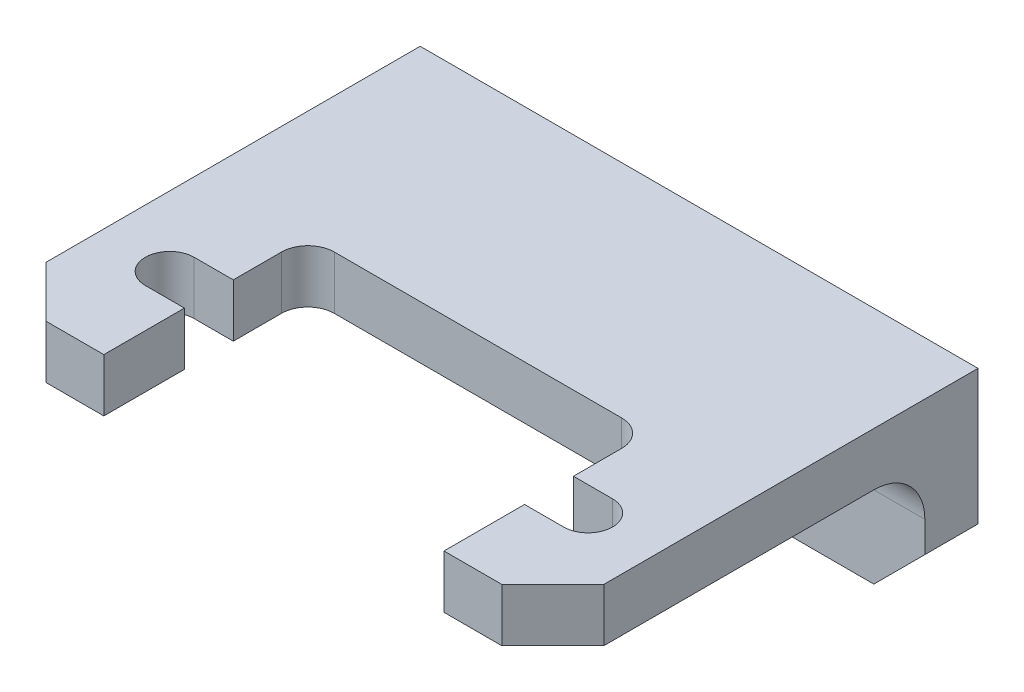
ISO-10303-21;
HEADER;
FILE_DESCRIPTION(('STEP AP214'),'2;1');
FILE_NAME('part.step','',(''),(''),'','','');
FILE_SCHEMA(('AUTOMOTIVE_DESIGN { 1 0 10303 214 1 1 1 1 }'));
ENDSEC;
DATA;
#1=APPLICATION_CONTEXT('core data for automotive mechanical design processes');
#2=APPLICATION_PROTOCOL_DEFINITION('international standard','automotive_design',2000,#1);
#3=PRODUCT_CONTEXT('',#1,'mechanical');
#4=PRODUCT('Part','Part','',(#3));
#5=PRODUCT_RELATED_PRODUCT_CATEGORY('part','',(#4));
#6=PRODUCT_DEFINITION_FORMATION('','',#4);
#7=PRODUCT_DEFINITION_CONTEXT('part definition',#1,'design');
#8=PRODUCT_DEFINITION('design','',#6,#7);
#9=PRODUCT_DEFINITION_SHAPE('','',#8);
#10=(LENGTH_UNIT() NAMED_UNIT(*) SI_UNIT(.MILLI.,.METRE.));
#11=(NAMED_UNIT(*) PLANE_ANGLE_UNIT() SI_UNIT($,.RADIAN.));
#12=(NAMED_UNIT(*) SI_UNIT($,.STERADIAN.) SOLID_ANGLE_UNIT());
#13=UNCERTAINTY_MEASURE_WITH_UNIT(LENGTH_MEASURE(1.E-05),#10,'distance_accuracy_value','');
#14=(GEOMETRIC_REPRESENTATION_CONTEXT(3) GLOBAL_UNCERTAINTY_ASSIGNED_CONTEXT((#13)) GLOBAL_UNIT_ASSIGNED_CONTEXT((#10,
#11,#12)) REPRESENTATION_CONTEXT('',''));
#15=CARTESIAN_POINT('',(0.,0.,0.));
#16=DIRECTION('',(0.,0.,1.));
#17=DIRECTION('',(1.,0.,0.));
#18=AXIS2_PLACEMENT_3D('',#15,#16,#17);
#19=CARTESIAN_POINT('',(-9.5249999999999,-1.60020000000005,-13.8490158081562));
#20=DIRECTION('',(0.,0.,-1.));
#21=DIRECTION('',(-1.,0.,0.));
#22=AXIS2_PLACEMENT_3D('',#19,#20,#21);
#23=CYLINDRICAL_SURFACE('',#22,2.99720000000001);
#24=CARTESIAN_POINT('',(-9.52500000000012,-1.60020000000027,-15.8750000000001));
#25=DIRECTION('',(0.,0.,-1.));
#26=DIRECTION('',(-1.,0.,0.));
#27=AXIS2_PLACEMENT_3D('',#24,#25,#26);
#28=CIRCLE('',#27,2.99720000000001);
#29=CARTESIAN_POINT('',(-6.5304918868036,-1.47320000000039,-15.8749999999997));
#30=VERTEX_POINT('',#29);
#31=CARTESIAN_POINT('',(-12.5195081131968,-1.47319999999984,-15.8750000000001));
#32=VERTEX_POINT('',#31);
#33=EDGE_CURVE('E224',#30,#32,#28,.F.);
#34=ORIENTED_EDGE('',*,*,#33,.F.);
#35=CARTESIAN_POINT('',(-12.5195081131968,-1.47319999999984,-15.8750000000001));
#36=CARTESIAN_POINT('',(-12.5166224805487,-1.40475595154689,-15.8750170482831));
#37=CARTESIAN_POINT('',(-12.5113573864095,-1.33642906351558,-15.8726952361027));
#38=CARTESIAN_POINT('',(-12.4962289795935,-1.20064891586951,-15.863547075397));
#39=CARTESIAN_POINT('',(-12.4863696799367,-1.13319494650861,-15.8567246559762));
#40=CARTESIAN_POINT('',(-12.4623088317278,-1.00023579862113,-15.8388229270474));
#41=CARTESIAN_POINT('',(-12.4481442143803,-0.934719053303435,-15.8277796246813));
#42=CARTESIAN_POINT('',(-12.4157014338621,-0.805533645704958,-15.8017056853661));
#43=CARTESIAN_POINT('',(-12.3974225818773,-0.741865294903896,-15.7866743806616));
#44=CARTESIAN_POINT('',(-12.3369724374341,-0.554670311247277,-15.7361634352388));
#45=CARTESIAN_POINT('',(-12.2890836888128,-0.434398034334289,-15.6951879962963));
#46=CARTESIAN_POINT('',(-12.1805678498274,-0.204711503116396,-15.6012961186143));
#47=CARTESIAN_POINT('',(-12.1199169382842,-0.0953181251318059,-15.5483573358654));
#48=CARTESIAN_POINT('',(-11.9706752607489,0.139348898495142,-15.4178488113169));
#49=CARTESIAN_POINT('',(-11.8789487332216,0.261059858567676,-15.337476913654));
#50=CARTESIAN_POINT('',(-11.6825039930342,0.485643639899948,-15.1664924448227));
#51=CARTESIAN_POINT('',(-11.5777541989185,0.58846910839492,-15.0758550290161));
#52=CARTESIAN_POINT('',(-11.3862249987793,0.751504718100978,-14.9128173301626));
#53=CARTESIAN_POINT('',(-11.3017826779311,0.815864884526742,-14.8417457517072));
#54=CARTESIAN_POINT('',(-11.1274555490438,0.934854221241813,-14.6979058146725));
#55=CARTESIAN_POINT('',(-11.0375651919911,0.98947323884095,-14.6251357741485));
#56=CARTESIAN_POINT('',(-10.852491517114,1.08903851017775,-14.4801651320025));
#57=CARTESIAN_POINT('',(-10.7573185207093,1.13400284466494,-14.4079637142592));
#58=CARTESIAN_POINT('',(-10.5606922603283,1.21437705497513,-14.2670496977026));
#59=CARTESIAN_POINT('',(-10.4592501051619,1.24980326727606,-14.1983312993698));
#60=CARTESIAN_POINT('',(-10.2847426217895,1.29998976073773,-14.0926498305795));
#61=CARTESIAN_POINT('',(-10.2141658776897,1.3176440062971,-14.0529880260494));
#62=CARTESIAN_POINT('',(-10.0684906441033,1.34824863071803,-13.9807992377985));
#63=CARTESIAN_POINT('',(-9.99340282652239,1.3612096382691,-13.948256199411));
#64=CARTESIAN_POINT('',(-9.85709220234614,1.37913182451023,-13.9017007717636));
#65=CARTESIAN_POINT('',(-9.79694079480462,1.38527213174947,-13.8851062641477));
#66=CARTESIAN_POINT('',(-9.67457589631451,1.39388931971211,-13.8615384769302));
#67=CARTESIAN_POINT('',(-9.61236841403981,1.39637605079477,-13.8545393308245));
#68=CARTESIAN_POINT('',(-9.48734614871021,1.39741779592,-13.8516279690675));
#69=CARTESIAN_POINT('',(-9.4245298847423,1.39595412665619,-13.8557684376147));
#70=CARTESIAN_POINT('',(-9.30059697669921,1.38923597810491,-13.8743073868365));
#71=CARTESIAN_POINT('',(-9.23948475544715,1.38397244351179,-13.888730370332));
#72=CARTESIAN_POINT('',(-9.08682424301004,1.36627804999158,-13.935404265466));
#73=CARTESIAN_POINT('',(-8.99729035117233,1.3514877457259,-13.9731109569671));
#74=CARTESIAN_POINT('',(-8.82440505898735,1.31531769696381,-14.058522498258));
#75=CARTESIAN_POINT('',(-8.7410885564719,1.29390379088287,-14.1062787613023));
#76=CARTESIAN_POINT('',(-8.56987153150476,1.2423038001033,-14.2127305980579));
#77=CARTESIAN_POINT('',(-8.48258982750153,1.21138085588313,-14.2720520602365));
#78=CARTESIAN_POINT('',(-8.31275532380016,1.14243941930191,-14.3934062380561));
#79=CARTESIAN_POINT('',(-8.23020792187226,1.10441303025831,-14.4554419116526));
#80=CARTESIAN_POINT('',(-8.06948639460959,1.02140984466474,-14.5799440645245));
#81=CARTESIAN_POINT('',(-7.99130012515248,0.976453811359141,-14.6424087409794));
#82=CARTESIAN_POINT('',(-7.83886538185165,0.879379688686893,-14.7665572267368));
#83=CARTESIAN_POINT('',(-7.76461571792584,0.827263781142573,-14.8282412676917));
#84=CARTESIAN_POINT('',(-7.67378082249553,0.757075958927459,-14.9046494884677));
#85=CARTESIAN_POINT('',(-7.65527024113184,0.742422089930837,-14.9202717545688));
#86=CARTESIAN_POINT('',(-7.61852526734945,0.712616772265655,-14.9513759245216));
#87=CARTESIAN_POINT('',(-7.60029095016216,0.69746519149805,-14.9668577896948));
#88=CARTESIAN_POINT('',(-7.46624378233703,0.583359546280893,-15.0809631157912));
#89=CARTESIAN_POINT('',(-7.35598233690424,0.474305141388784,-15.1764545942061));
#90=CARTESIAN_POINT('',(-7.14983494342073,0.234672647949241,-15.3560112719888));
#91=CARTESIAN_POINT('',(-7.05396394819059,0.104072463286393,-15.4400645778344));
#92=CARTESIAN_POINT('',(-6.89996219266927,-0.147872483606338,-15.5746542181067));
#93=CARTESIAN_POINT('',(-6.83814871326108,-0.265172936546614,-15.6285114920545));
#94=CARTESIAN_POINT('',(-6.72932961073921,-0.511430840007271,-15.7222596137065));
#95=CARTESIAN_POINT('',(-6.68227701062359,-0.640349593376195,-15.7621948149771));
#96=CARTESIAN_POINT('',(-6.62801302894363,-0.829443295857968,-15.8067969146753));
#97=CARTESIAN_POINT('',(-6.61354327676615,-0.88600629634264,-15.8184694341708));
#98=CARTESIAN_POINT('',(-6.5878411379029,-1.00041992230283,-15.8386690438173));
#99=CARTESIAN_POINT('',(-6.57660804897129,-1.05827026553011,-15.8471968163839));
#100=CARTESIAN_POINT('',(-6.55747321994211,-1.17531173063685,-15.8609841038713));
#101=CARTESIAN_POINT('',(-6.54959452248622,-1.23450927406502,-15.8662211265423));
#102=CARTESIAN_POINT('',(-6.53736767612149,-1.35350885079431,-15.8732351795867));
#103=CARTESIAN_POINT('',(-6.53302181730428,-1.41331125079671,-15.875009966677));
#104=CARTESIAN_POINT('',(-6.5304918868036,-1.47320000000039,-15.8749999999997));
#105=B_SPLINE_CURVE_WITH_KNOTS('',3,(#35,#36,#37,#38,#39,#40,#41,#42,#43,#44,#45,#46,#47,#48,
#49,#50,#51,#52,#53,#54,#55,#56,#57,#58,#59,#60,#61,#62,#63,#64,#65,#66,#67,#68,#69,#70,#71,#72,
#73,#74,#75,#76,#77,#78,#79,#80,#81,#82,#83,#84,#85,#86,#87,#88,#89,#90,#91,#92,#93,#94,#95,#96,
#97,#98,#99,#100,#101,#102,#103,#104),.UNSPECIFIED.,.F.,.F.,(4,2,2,2,2,2,2,2,2,2,2,2,2,2,2,2,2,
2,2,2,2,2,2,2,2,2,2,2,2,2,2,2,2,2,4),(0.,0.205408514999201,0.410637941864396,0.614154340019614,
0.817704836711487,1.22311627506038,1.62929125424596,2.14395478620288,2.65989165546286,
3.04270422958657,3.42591348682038,3.80839870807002,4.19022459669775,4.43846688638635,
4.68614341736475,4.8735608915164,5.06047213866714,5.24826892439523,5.43651472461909,
5.72964985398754,6.02432278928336,6.35375997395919,6.68356558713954,7.01240155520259,
7.34113753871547,7.42606121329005,7.51100761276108,8.0553158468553,8.60018580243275,
9.02794088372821,9.45432047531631,9.6327939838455,9.8112287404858,9.99087019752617,
10.1706280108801),.UNSPECIFIED.);
#106=EDGE_CURVE('E213',#32,#30,#105,.T.);
#107=ORIENTED_EDGE('',*,*,#106,.F.);
#108=EDGE_LOOP('',(#34,#107));
#109=FACE_BOUND('',#108,.T.);
#110=ADVANCED_FACE('F32',(#109),#23,.F.);
#111=CARTESIAN_POINT('',(9.52500000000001,-1.60020000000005,-13.8490158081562));
#112=DIRECTION('',(0.,0.,-1.));
#113=DIRECTION('',(-1.,0.,0.));
#114=AXIS2_PLACEMENT_3D('',#111,#112,#113);
#115=CYLINDRICAL_SURFACE('',#114,2.99720000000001);
#116=CARTESIAN_POINT('',(9.52499999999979,-1.60020000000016,-15.875));
#117=DIRECTION('',(0.,0.,-1.));
#118=DIRECTION('',(-1.,0.,0.));
#119=AXIS2_PLACEMENT_3D('',#116,#117,#118);
#120=CIRCLE('',#119,2.99720000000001);
#121=CARTESIAN_POINT('',(12.5195081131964,-1.47320000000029,-15.8749999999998));
#122=VERTEX_POINT('',#121);
#123=CARTESIAN_POINT('',(6.53049188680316,-1.47320000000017,-15.8750000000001));
#124=VERTEX_POINT('',#123);
#125=EDGE_CURVE('E230',#122,#124,#120,.F.);
#126=ORIENTED_EDGE('',*,*,#125,.F.);
#127=CARTESIAN_POINT('',(6.53049188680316,-1.47320000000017,-15.8750000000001));
#128=CARTESIAN_POINT('',(6.53337751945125,-1.40475595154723,-15.8750170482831));
#129=CARTESIAN_POINT('',(6.53864261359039,-1.33642906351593,-15.8726952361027));
#130=CARTESIAN_POINT('',(6.55377102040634,-1.20064891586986,-15.8635470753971));
#131=CARTESIAN_POINT('',(6.56363032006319,-1.13319494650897,-15.8567246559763));
#132=CARTESIAN_POINT('',(6.58769116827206,-1.00023579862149,-15.8388229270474));
#133=CARTESIAN_POINT('',(6.60185578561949,-0.934719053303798,-15.8277796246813));
#134=CARTESIAN_POINT('',(6.63429856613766,-0.80553364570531,-15.8017056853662));
#135=CARTESIAN_POINT('',(6.6525774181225,-0.741865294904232,-15.7866743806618));
#136=CARTESIAN_POINT('',(6.71302756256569,-0.554670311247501,-15.7361634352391));
#137=CARTESIAN_POINT('',(6.76091631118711,-0.434398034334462,-15.6951879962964));
#138=CARTESIAN_POINT('',(6.86943215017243,-0.204711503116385,-15.6012961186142));
#139=CARTESIAN_POINT('',(6.93008306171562,-0.0953181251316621,-15.5483573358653));
#140=CARTESIAN_POINT('',(7.07932473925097,0.139348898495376,-15.4178488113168));
#141=CARTESIAN_POINT('',(7.17105126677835,0.261059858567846,-15.3374769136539));
#142=CARTESIAN_POINT('',(7.36749600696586,0.485643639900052,-15.1664924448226));
#143=CARTESIAN_POINT('',(7.47224580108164,0.588469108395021,-15.075855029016));
#144=CARTESIAN_POINT('',(7.66377500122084,0.751504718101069,-14.9128173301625));
#145=CARTESIAN_POINT('',(7.74821732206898,0.815864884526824,-14.8417457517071));
#146=CARTESIAN_POINT('',(7.92254445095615,0.934854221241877,-14.6979058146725));
#147=CARTESIAN_POINT('',(8.01243480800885,0.989473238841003,-14.6251357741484));
#148=CARTESIAN_POINT('',(8.1975084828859,1.08903851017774,-14.4801651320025));
#149=CARTESIAN_POINT('',(8.29268147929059,1.13400284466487,-14.4079637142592));
#150=CARTESIAN_POINT('',(8.48930773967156,1.21437705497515,-14.2670496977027));
#151=CARTESIAN_POINT('',(8.59074989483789,1.24980326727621,-14.19833129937));
#152=CARTESIAN_POINT('',(8.76525737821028,1.29998976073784,-14.0926498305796));
#153=CARTESIAN_POINT('',(8.83583412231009,1.31764400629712,-14.0529880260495));
#154=CARTESIAN_POINT('',(8.98150935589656,1.34824863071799,-13.9807992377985));
#155=CARTESIAN_POINT('',(9.05659717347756,1.36120963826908,-13.948256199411));
#156=CARTESIAN_POINT('',(9.19290779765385,1.37913182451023,-13.9017007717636));
#157=CARTESIAN_POINT('',(9.25305920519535,1.38527213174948,-13.8851062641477));
#158=CARTESIAN_POINT('',(9.37542410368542,1.39388931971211,-13.8615384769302));
#159=CARTESIAN_POINT('',(9.4376315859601,1.39637605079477,-13.8545393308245));
#160=CARTESIAN_POINT('',(9.56265385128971,1.39741779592,-13.8516279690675));
#161=CARTESIAN_POINT('',(9.62547011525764,1.39595412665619,-13.8557684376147));
#162=CARTESIAN_POINT('',(9.74940302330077,1.38923597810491,-13.8743073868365));
#163=CARTESIAN_POINT('',(9.81051524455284,1.38397244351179,-13.8887303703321));
#164=CARTESIAN_POINT('',(9.96317575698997,1.36627804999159,-13.9354042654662));
#165=CARTESIAN_POINT('',(10.0527096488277,1.35148774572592,-13.9731109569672));
#166=CARTESIAN_POINT('',(10.2255949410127,1.31531769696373,-14.058522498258));
#167=CARTESIAN_POINT('',(10.3089114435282,1.29390379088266,-14.1062787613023));
#168=CARTESIAN_POINT('',(10.4801284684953,1.24230380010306,-14.2127305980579));
#169=CARTESIAN_POINT('',(10.5674101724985,1.21138085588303,-14.2720520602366));
#170=CARTESIAN_POINT('',(10.7372446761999,1.1424394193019,-14.3934062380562));
#171=CARTESIAN_POINT('',(10.8197920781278,1.10441303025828,-14.4554419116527));
#172=CARTESIAN_POINT('',(10.9805136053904,1.02140984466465,-14.5799440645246));
#173=CARTESIAN_POINT('',(11.0586998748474,0.976453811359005,-14.6424087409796));
#174=CARTESIAN_POINT('',(11.2111346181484,0.879379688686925,-14.7665572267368));
#175=CARTESIAN_POINT('',(11.2853842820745,0.827263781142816,-14.8282412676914));
#176=CARTESIAN_POINT('',(11.3762191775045,0.757075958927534,-14.9046494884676));
#177=CARTESIAN_POINT('',(11.3947297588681,0.742422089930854,-14.9202717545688));
#178=CARTESIAN_POINT('',(11.4314747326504,0.712616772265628,-14.9513759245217));
#179=CARTESIAN_POINT('',(11.4497090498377,0.697465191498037,-14.9668577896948));
#180=CARTESIAN_POINT('',(11.583756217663,0.58335954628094,-15.0809631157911));
#181=CARTESIAN_POINT('',(11.6940176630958,0.474305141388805,-15.1764545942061));
#182=CARTESIAN_POINT('',(11.9001650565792,0.234672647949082,-15.3560112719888));
#183=CARTESIAN_POINT('',(11.9960360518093,0.10407246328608,-15.4400645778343));
#184=CARTESIAN_POINT('',(12.1500378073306,-0.147872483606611,-15.5746542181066));
#185=CARTESIAN_POINT('',(12.2118512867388,-0.265172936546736,-15.6285114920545));
#186=CARTESIAN_POINT('',(12.3206703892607,-0.511430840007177,-15.7222596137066));
#187=CARTESIAN_POINT('',(12.3677229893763,-0.640349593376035,-15.7621948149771));
#188=CARTESIAN_POINT('',(12.4219869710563,-0.829443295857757,-15.8067969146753));
#189=CARTESIAN_POINT('',(12.4364567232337,-0.886006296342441,-15.8184694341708));
#190=CARTESIAN_POINT('',(12.462158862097,-1.00041992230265,-15.8386690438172));
#191=CARTESIAN_POINT('',(12.4733919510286,-1.05827026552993,-15.8471968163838));
#192=CARTESIAN_POINT('',(12.4925267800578,-1.17531173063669,-15.8609841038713));
#193=CARTESIAN_POINT('',(12.5004054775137,-1.23450927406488,-15.8662211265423));
#194=CARTESIAN_POINT('',(12.5126323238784,-1.35350885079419,-15.8732351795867));
#195=CARTESIAN_POINT('',(12.5169781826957,-1.41331125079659,-15.8750099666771));
#196=CARTESIAN_POINT('',(12.5195081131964,-1.47320000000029,-15.8749999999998));
#197=B_SPLINE_CURVE_WITH_KNOTS('',3,(#127,#128,#129,#130,#131,#132,#133,#134,#135,#136,#137,
#138,#139,#140,#141,#142,#143,#144,#145,#146,#147,#148,#149,#150,#151,#152,#153,#154,#155,#156,
#157,#158,#159,#160,#161,#162,#163,#164,#165,#166,#167,#168,#169,#170,#171,#172,#173,#174,#175,
#176,#177,#178,#179,#180,#181,#182,#183,#184,#185,#186,#187,#188,#189,#190,#191,#192,#193,#194,
#195,#196),.UNSPECIFIED.,.F.,.F.,(4,2,2,2,2,2,2,2,2,2,2,2,2,2,2,2,2,2,2,2,2,2,2,2,2,2,2,2,2,2,2,
2,2,2,4),(0.,0.205408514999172,0.410637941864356,0.61415434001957,0.817704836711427,
1.22311627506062,1.62929125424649,2.14395478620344,2.65989165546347,3.04270422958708,
3.42591348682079,3.80839870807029,4.19022459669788,4.43846688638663,4.68614341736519,
4.87356089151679,5.06047213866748,5.24826892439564,5.43651472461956,5.72964985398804,
6.02432278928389,6.35375997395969,6.68356558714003,7.01240155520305,7.34113753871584,
7.4260612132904,7.51100761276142,8.05531584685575,8.60018580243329,9.02794088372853,
9.4543204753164,9.63279398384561,9.81122874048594,9.99087019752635,10.1706280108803),.UNSPECIFIED.);
#198=EDGE_CURVE('E208',#124,#122,#197,.T.);
#199=ORIENTED_EDGE('',*,*,#198,.F.);
#200=EDGE_LOOP('',(#126,#199));
#201=FACE_BOUND('',#200,.T.);
#202=ADVANCED_FACE('F267',(#201),#115,.F.);
#203=CARTESIAN_POINT('',(13.6143999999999,-6.35000000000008,-15.875));
#204=DIRECTION('',(0.707106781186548,-0.707106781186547,0.));
#205=DIRECTION('',(0.,0.,-1.));
#206=AXIS2_PLACEMENT_3D('',#203,#204,#205);
#207=PLANE('',#206);
#208=DIRECTION('',(-0.707106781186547,-0.707106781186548,0.));
#209=VECTOR('',#208,1.);
#210=CARTESIAN_POINT('',(16.6624000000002,-3.30200000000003,-19.05));
#211=LINE('',#210,#209);
#212=CARTESIAN_POINT('',(16.6624000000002,-3.30200000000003,-19.05));
#213=VERTEX_POINT('',#212);
#214=CARTESIAN_POINT('',(13.6144,-6.34999999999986,-19.05));
#215=VERTEX_POINT('',#214);
#216=EDGE_CURVE('E488',#213,#215,#211,.T.);
#217=ORIENTED_EDGE('',*,*,#216,.F.);
#218=DIRECTION('',(0.,0.,1.));
#219=VECTOR('',#218,1.);
#220=CARTESIAN_POINT('',(16.6624000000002,-3.30200000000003,-19.05));
#221=LINE('',#220,#219);
#222=CARTESIAN_POINT('',(16.6623999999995,-3.30200000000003,-15.8750000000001));
#223=VERTEX_POINT('',#222);
#224=EDGE_CURVE('E498',#223,#213,#221,.F.);
#225=ORIENTED_EDGE('',*,*,#224,.F.);
#226=DIRECTION('',(0.707106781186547,0.707106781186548,0.));
#227=VECTOR('',#226,1.);
#228=CARTESIAN_POINT('',(13.6143999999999,-6.35000000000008,-15.875));
#229=LINE('',#228,#227);
#230=CARTESIAN_POINT('',(13.6143999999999,-6.35000000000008,-15.875));
#231=VERTEX_POINT('',#230);
#232=EDGE_CURVE('E239',#231,#223,#229,.T.);
#233=ORIENTED_EDGE('',*,*,#232,.F.);
#234=DIRECTION('',(0.,0.,-1.));
#235=VECTOR('',#234,1.);
#236=CARTESIAN_POINT('',(13.6143999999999,-6.35000000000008,-15.875));
#237=LINE('',#236,#235);
#238=EDGE_CURVE('E36',#215,#231,#237,.F.);
#239=ORIENTED_EDGE('',*,*,#238,.F.);
#240=EDGE_LOOP('',(#217,#225,#233,#239));
#241=FACE_BOUND('',#240,.T.);
#242=ADVANCED_FACE('F271',(#241),#207,.T.);
#243=CARTESIAN_POINT('',(-13.6144000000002,-6.35000000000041,-15.875));
#244=DIRECTION('',(0.,-1.,0.));
#245=DIRECTION('',(0.,0.,-1.));
#246=AXIS2_PLACEMENT_3D('',#243,#244,#245);
#247=PLANE('',#246);
#248=DIRECTION('',(0.,0.,1.));
#249=VECTOR('',#248,1.);
#250=CARTESIAN_POINT('',(-13.6144000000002,-6.3500000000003,-19.05));
#251=LINE('',#250,#249);
#252=CARTESIAN_POINT('',(-13.6144000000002,-6.3500000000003,-19.05));
#253=VERTEX_POINT('',#252);
#254=CARTESIAN_POINT('',(-13.6144000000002,-6.35000000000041,-15.875));
#255=VERTEX_POINT('',#254);
#256=EDGE_CURVE('E231',#253,#255,#251,.T.);
#257=ORIENTED_EDGE('',*,*,#256,.F.);
#258=DIRECTION('',(-1.,0.,0.));
#259=VECTOR('',#258,1.);
#260=CARTESIAN_POINT('',(16.6623999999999,-6.35000000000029,-19.0499999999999));
#261=LINE('',#260,#259);
#262=EDGE_CURVE('E485',#215,#253,#261,.T.);
#263=ORIENTED_EDGE('',*,*,#262,.F.);
#264=ORIENTED_EDGE('',*,*,#238,.T.);
#265=DIRECTION('',(1.,0.,0.));
#266=VECTOR('',#265,1.);
#267=CARTESIAN_POINT('',(-16.6624,-6.34999999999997,-15.8750000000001));
#268=LINE('',#267,#266);
#269=EDGE_CURVE('E236',#255,#231,#268,.T.);
#270=ORIENTED_EDGE('',*,*,#269,.F.);
#271=EDGE_LOOP('',(#257,#263,#264,#270));
#272=FACE_BOUND('',#271,.T.);
#273=ADVANCED_FACE('F274',(#272),#247,.T.);
#274=CARTESIAN_POINT('',(9.5249999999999,-1.60020000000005,-19.05));
#275=DIRECTION('',(0.,0.,1.));
#276=DIRECTION('',(1.,0.,0.));
#277=AXIS2_PLACEMENT_3D('',#274,#275,#276);
#278=CYLINDRICAL_SURFACE('',#277,1.70179999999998);
#279=CARTESIAN_POINT('',(9.52499999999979,-1.60020000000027,-15.875));
#280=DIRECTION('',(0.,0.,1.));
#281=DIRECTION('',(1.,0.,0.));
#282=AXIS2_PLACEMENT_3D('',#279,#280,#281);
#283=CIRCLE('',#282,1.70179999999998);
#284=CARTESIAN_POINT('',(11.2267999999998,-1.60020000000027,-15.875));
#285=VERTEX_POINT('',#284);
#286=EDGE_CURVE('E245',#285,#285,#283,.F.);
#287=ORIENTED_EDGE('',*,*,#286,.F.);
#288=EDGE_LOOP('',(#287));
#289=FACE_BOUND('',#288,.T.);
#290=CARTESIAN_POINT('',(9.5249999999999,-1.60020000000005,-19.05));
#291=DIRECTION('',(0.,0.,1.));
#292=DIRECTION('',(1.,0.,0.));
#293=AXIS2_PLACEMENT_3D('',#290,#291,#292);
#294=CIRCLE('',#293,1.70179999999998);
#295=CARTESIAN_POINT('',(11.2267999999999,-1.60020000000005,-19.05));
#296=VERTEX_POINT('',#295);
#297=EDGE_CURVE('E476',#296,#296,#294,.F.);
#298=ORIENTED_EDGE('',*,*,#297,.T.);
#299=EDGE_LOOP('',(#298));
#300=FACE_BOUND('',#299,.T.);
#301=ADVANCED_FACE('F278',(#289,#300),#278,.F.);
#302=CARTESIAN_POINT('',(-9.52500000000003,-1.60020000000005,-19.05));
#303=DIRECTION('',(0.,0.,1.));
#304=DIRECTION('',(1.,0.,0.));
#305=AXIS2_PLACEMENT_3D('',#302,#303,#304);
#306=CYLINDRICAL_SURFACE('',#305,1.70179999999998);
#307=CARTESIAN_POINT('',(-9.52500000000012,-1.60020000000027,-15.8750000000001));
#308=DIRECTION('',(0.,0.,1.));
#309=DIRECTION('',(1.,0.,0.));
#310=AXIS2_PLACEMENT_3D('',#307,#308,#309);
#311=CIRCLE('',#310,1.70179999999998);
#312=CARTESIAN_POINT('',(-7.82320000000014,-1.60020000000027,-15.8750000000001));
#313=VERTEX_POINT('',#312);
#314=EDGE_CURVE('E248',#313,#313,#311,.F.);
#315=ORIENTED_EDGE('',*,*,#314,.F.);
#316=EDGE_LOOP('',(#315));
#317=FACE_BOUND('',#316,.T.);
#318=CARTESIAN_POINT('',(-9.52500000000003,-1.60020000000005,-19.05));
#319=DIRECTION('',(0.,0.,1.));
#320=DIRECTION('',(1.,0.,0.));
#321=AXIS2_PLACEMENT_3D('',#318,#319,#320);
#322=CIRCLE('',#321,1.70179999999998);
#323=CARTESIAN_POINT('',(-7.82320000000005,-1.60020000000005,-19.05));
#324=VERTEX_POINT('',#323);
#325=EDGE_CURVE('E473',#324,#324,#322,.F.);
#326=ORIENTED_EDGE('',*,*,#325,.T.);
#327=EDGE_LOOP('',(#326));
#328=FACE_BOUND('',#327,.T.);
#329=ADVANCED_FACE('F282',(#317,#328),#306,.F.);
#330=CARTESIAN_POINT('',(-13.6144000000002,-6.3500000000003,-19.05));
#331=DIRECTION('',(-0.707106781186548,-0.707106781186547,0.));
#332=DIRECTION('',(0.,0.,1.));
#333=AXIS2_PLACEMENT_3D('',#330,#331,#332);
#334=PLANE('',#333);
#335=DIRECTION('',(0.707106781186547,-0.707106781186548,0.));
#336=VECTOR('',#335,1.);
#337=CARTESIAN_POINT('',(-16.6624000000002,-3.30200000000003,-15.8750000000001));
#338=LINE('',#337,#336);
#339=CARTESIAN_POINT('',(-16.6624000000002,-3.30200000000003,-15.8750000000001));
#340=VERTEX_POINT('',#339);
#341=EDGE_CURVE('E226',#340,#255,#338,.T.);
#342=ORIENTED_EDGE('',*,*,#341,.F.);
#343=DIRECTION('',(0.,0.,-1.));
#344=VECTOR('',#343,1.);
#345=CARTESIAN_POINT('',(-16.6623999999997,-3.30200000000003,3.30199999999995));
#346=LINE('',#345,#344);
#347=CARTESIAN_POINT('',(-16.6624000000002,-3.30200000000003,-19.05));
#348=VERTEX_POINT('',#347);
#349=EDGE_CURVE('E470',#348,#340,#346,.F.);
#350=ORIENTED_EDGE('',*,*,#349,.F.);
#351=DIRECTION('',(-0.707106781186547,0.707106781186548,0.));
#352=VECTOR('',#351,1.);
#353=CARTESIAN_POINT('',(-13.6144000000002,-6.3500000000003,-19.05));
#354=LINE('',#353,#352);
#355=EDGE_CURVE('E482',#253,#348,#354,.T.);
#356=ORIENTED_EDGE('',*,*,#355,.F.);
#357=ORIENTED_EDGE('',*,*,#256,.T.);
#358=EDGE_LOOP('',(#342,#350,#356,#357));
#359=FACE_BOUND('',#358,.T.);
#360=ADVANCED_FACE('F286',(#359),#334,.T.);
#361=CARTESIAN_POINT('',(-16.6624,-6.34999999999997,-15.8750000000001));
#362=DIRECTION('',(0.,0.,1.));
#363=DIRECTION('',(1.,0.,0.));
#364=AXIS2_PLACEMENT_3D('',#361,#362,#363);
#365=PLANE('',#364);
#366=ORIENTED_EDGE('',*,*,#314,.T.);
#367=EDGE_LOOP('',(#366));
#368=FACE_BOUND('',#367,.T.);
#369=ORIENTED_EDGE('',*,*,#286,.T.);
#370=EDGE_LOOP('',(#369));
#371=FACE_BOUND('',#370,.T.);
#372=DIRECTION('',(1.,0.,0.));
#373=VECTOR('',#372,1.);
#374=CARTESIAN_POINT('',(-16.6624000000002,-1.47320000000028,-15.8750000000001));
#375=LINE('',#374,#373);
#376=CARTESIAN_POINT('',(16.6623999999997,-1.47320000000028,-15.8749999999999));
#377=VERTEX_POINT('',#376);
#378=EDGE_CURVE('E242',#377,#122,#375,.F.);
#379=ORIENTED_EDGE('',*,*,#378,.T.);
#380=ORIENTED_EDGE('',*,*,#125,.T.);
#381=DIRECTION('',(1.,0.,0.));
#382=VECTOR('',#381,1.);
#383=CARTESIAN_POINT('',(-16.6624000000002,-1.47320000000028,-15.8750000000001));
#384=LINE('',#383,#382);
#385=EDGE_CURVE('E217',#124,#30,#384,.F.);
#386=ORIENTED_EDGE('',*,*,#385,.T.);
#387=ORIENTED_EDGE('',*,*,#33,.T.);
#388=DIRECTION('',(-1.,0.,0.));
#389=VECTOR('',#388,1.);
#390=CARTESIAN_POINT('',(-11.464025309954,-1.47320000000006,-15.8750000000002));
#391=LINE('',#390,#389);
#392=CARTESIAN_POINT('',(-16.6624000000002,-1.47320000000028,-15.8750000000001));
#393=VERTEX_POINT('',#392);
#394=EDGE_CURVE('E220',#393,#32,#391,.F.);
#395=ORIENTED_EDGE('',*,*,#394,.F.);
#396=DIRECTION('',(0.,-1.,0.));
#397=VECTOR('',#396,1.);
#398=CARTESIAN_POINT('',(-16.6624000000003,4.74979999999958,-15.875));
#399=LINE('',#398,#397);
#400=EDGE_CURVE('E467',#340,#393,#399,.F.);
#401=ORIENTED_EDGE('',*,*,#400,.F.);
#402=ORIENTED_EDGE('',*,*,#341,.T.);
#403=ORIENTED_EDGE('',*,*,#269,.T.);
#404=ORIENTED_EDGE('',*,*,#232,.T.);
#405=DIRECTION('',(0.,-1.,0.));
#406=VECTOR('',#405,1.);
#407=CARTESIAN_POINT('',(16.6623999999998,4.74979999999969,-15.8749999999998));
#408=LINE('',#407,#406);
#409=EDGE_CURVE('E491',#377,#223,#408,.T.);
#410=ORIENTED_EDGE('',*,*,#409,.F.);
#411=EDGE_LOOP('',(#379,#380,#386,#387,#395,#401,#402,#403,#404,#410));
#412=FACE_BOUND('',#411,.T.);
#413=ADVANCED_FACE('F229',(#368,#371,#412),#365,.T.);
#414=CARTESIAN_POINT('',(16.6623999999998,-1.47320000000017,-12.827));
#415=DIRECTION('',(-1.,0.,0.));
#416=DIRECTION('',(0.,0.,1.));
#417=AXIS2_PLACEMENT_3D('',#414,#415,#416);
#418=CYLINDRICAL_SURFACE('',#417,3.04799999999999);
#419=ORIENTED_EDGE('',*,*,#106,.T.);
#420=ORIENTED_EDGE('',*,*,#385,.F.);
#421=ORIENTED_EDGE('',*,*,#198,.T.);
#422=ORIENTED_EDGE('',*,*,#378,.F.);
#423=CARTESIAN_POINT('',(16.6623999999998,-1.47320000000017,-12.827));
#424=DIRECTION('',(-1.,0.,0.));
#425=DIRECTION('',(0.,0.,1.));
#426=AXIS2_PLACEMENT_3D('',#423,#424,#425);
#427=CIRCLE('',#426,3.04799999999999);
#428=CARTESIAN_POINT('',(16.6624000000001,1.57479999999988,-12.8269999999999));
#429=VERTEX_POINT('',#428);
#430=EDGE_CURVE('E494',#429,#377,#427,.T.);
#431=ORIENTED_EDGE('',*,*,#430,.F.);
#432=DIRECTION('',(1.,0.,0.));
#433=VECTOR('',#432,1.);
#434=CARTESIAN_POINT('',(-16.6623999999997,1.57479999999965,-12.827));
#435=LINE('',#434,#433);
#436=CARTESIAN_POINT('',(-16.6623999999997,1.57479999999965,-12.827));
#437=VERTEX_POINT('',#436);
#438=EDGE_CURVE('E424',#437,#429,#435,.T.);
#439=ORIENTED_EDGE('',*,*,#438,.F.);
#440=CARTESIAN_POINT('',(-16.6624,-1.47320000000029,-12.827));
#441=DIRECTION('',(-1.,0.,0.));
#442=DIRECTION('',(0.,0.,1.));
#443=AXIS2_PLACEMENT_3D('',#440,#441,#442);
#444=CIRCLE('',#443,3.04799999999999);
#445=EDGE_CURVE('E464',#393,#437,#444,.F.);
#446=ORIENTED_EDGE('',*,*,#445,.F.);
#447=ORIENTED_EDGE('',*,*,#394,.T.);
#448=EDGE_LOOP('',(#419,#420,#421,#422,#431,#439,#446,#447));
#449=FACE_BOUND('',#448,.T.);
#450=ADVANCED_FACE('F215',(#449),#418,.F.);
#451=CARTESIAN_POINT('',(13.6143999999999,1.57479999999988,6.35000000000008));
#452=DIRECTION('',(0.707106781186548,0.,0.707106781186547));
#453=DIRECTION('',(0.707106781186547,0.,-0.707106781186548));
#454=AXIS2_PLACEMENT_3D('',#451,#452,#453);
#455=PLANE('',#454);
#456=DIRECTION('',(-0.707106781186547,0.,0.707106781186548));
#457=VECTOR('',#456,1.);
#458=CARTESIAN_POINT('',(16.6624000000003,1.57479999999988,3.30200000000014));
#459=LINE('',#458,#457);
#460=CARTESIAN_POINT('',(16.6624000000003,1.57479999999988,3.30200000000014));
#461=VERTEX_POINT('',#460);
#462=CARTESIAN_POINT('',(13.6143999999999,1.57479999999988,6.35000000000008));
#463=VERTEX_POINT('',#462);
#464=EDGE_CURVE('E418',#461,#463,#459,.T.);
#465=ORIENTED_EDGE('',*,*,#464,.F.);
#466=DIRECTION('',(0.,-1.,0.));
#467=VECTOR('',#466,1.);
#468=CARTESIAN_POINT('',(16.6624000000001,4.74980000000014,3.30200000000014));
#469=LINE('',#468,#467);
#470=CARTESIAN_POINT('',(16.6624,4.74980000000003,3.30200000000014));
#471=VERTEX_POINT('',#470);
#472=EDGE_CURVE('E497',#471,#461,#469,.T.);
#473=ORIENTED_EDGE('',*,*,#472,.F.);
#474=DIRECTION('',(0.707106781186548,0.,-0.707106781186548));
#475=VECTOR('',#474,1.);
#476=CARTESIAN_POINT('',(13.6144,4.74980000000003,6.34999999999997));
#477=LINE('',#476,#475);
#478=CARTESIAN_POINT('',(13.6144,4.74980000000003,6.34999999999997));
#479=VERTEX_POINT('',#478);
#480=EDGE_CURVE('E366',#479,#471,#477,.T.);
#481=ORIENTED_EDGE('',*,*,#480,.F.);
#482=DIRECTION('',(0.,1.,0.));
#483=VECTOR('',#482,1.);
#484=CARTESIAN_POINT('',(13.6143999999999,1.57479999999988,6.35000000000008));
#485=LINE('',#484,#483);
#486=EDGE_CURVE('E431',#463,#479,#485,.T.);
#487=ORIENTED_EDGE('',*,*,#486,.F.);
#488=EDGE_LOOP('',(#465,#473,#481,#487));
#489=FACE_BOUND('',#488,.T.);
#490=ADVANCED_FACE('F295',(#489),#455,.T.);
#491=CARTESIAN_POINT('',(16.6623999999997,4.74980000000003,-19.0499999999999));
#492=DIRECTION('',(1.,0.,0.));
#493=DIRECTION('',(0.,0.,1.));
#494=AXIS2_PLACEMENT_3D('',#491,#492,#493);
#495=PLANE('',#494);
#496=ORIENTED_EDGE('',*,*,#430,.T.);
#497=ORIENTED_EDGE('',*,*,#409,.T.);
#498=ORIENTED_EDGE('',*,*,#224,.T.);
#499=DIRECTION('',(0.,1.,0.));
#500=VECTOR('',#499,1.);
#501=CARTESIAN_POINT('',(16.6623999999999,-6.35000000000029,-19.0499999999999));
#502=LINE('',#501,#500);
#503=CARTESIAN_POINT('',(16.6623999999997,4.74980000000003,-19.0499999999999));
#504=VERTEX_POINT('',#503);
#505=EDGE_CURVE('E479',#504,#213,#502,.F.);
#506=ORIENTED_EDGE('',*,*,#505,.F.);
#507=DIRECTION('',(0.,0.,1.));
#508=VECTOR('',#507,1.);
#509=CARTESIAN_POINT('',(16.6623999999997,4.74980000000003,-19.0499999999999));
#510=LINE('',#509,#508);
#511=EDGE_CURVE('E363',#471,#504,#510,.F.);
#512=ORIENTED_EDGE('',*,*,#511,.F.);
#513=ORIENTED_EDGE('',*,*,#472,.T.);
#514=DIRECTION('',(0.,0.,-1.));
#515=VECTOR('',#514,1.);
#516=CARTESIAN_POINT('',(16.6624,1.5748000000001,6.35000000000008));
#517=LINE('',#516,#515);
#518=EDGE_CURVE('E421',#429,#461,#517,.F.);
#519=ORIENTED_EDGE('',*,*,#518,.F.);
#520=EDGE_LOOP('',(#496,#497,#498,#506,#512,#513,#519));
#521=FACE_BOUND('',#520,.T.);
#522=ADVANCED_FACE('F504',(#521),#495,.T.);
#523=CARTESIAN_POINT('',(16.6623999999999,-6.35000000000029,-19.0499999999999));
#524=DIRECTION('',(0.,0.,-1.));
#525=DIRECTION('',(-1.,0.,0.));
#526=AXIS2_PLACEMENT_3D('',#523,#524,#525);
#527=PLANE('',#526);
#528=ORIENTED_EDGE('',*,*,#325,.F.);
#529=EDGE_LOOP('',(#528));
#530=FACE_BOUND('',#529,.T.);
#531=ORIENTED_EDGE('',*,*,#297,.F.);
#532=EDGE_LOOP('',(#531));
#533=FACE_BOUND('',#532,.T.);
#534=DIRECTION('',(1.,0.,0.));
#535=VECTOR('',#534,1.);
#536=CARTESIAN_POINT('',(-16.6624000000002,4.7497999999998,-19.0499999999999));
#537=LINE('',#536,#535);
#538=CARTESIAN_POINT('',(-16.6624000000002,4.7497999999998,-19.0499999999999));
#539=VERTEX_POINT('',#538);
#540=EDGE_CURVE('E360',#504,#539,#537,.F.);
#541=ORIENTED_EDGE('',*,*,#540,.F.);
#542=ORIENTED_EDGE('',*,*,#505,.T.);
#543=ORIENTED_EDGE('',*,*,#216,.T.);
#544=ORIENTED_EDGE('',*,*,#262,.T.);
#545=ORIENTED_EDGE('',*,*,#355,.T.);
#546=DIRECTION('',(0.,-1.,0.));
#547=VECTOR('',#546,1.);
#548=CARTESIAN_POINT('',(-16.6624000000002,4.7497999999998,-19.0499999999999));
#549=LINE('',#548,#547);
#550=EDGE_CURVE('E461',#539,#348,#549,.T.);
#551=ORIENTED_EDGE('',*,*,#550,.F.);
#552=EDGE_LOOP('',(#541,#542,#543,#544,#545,#551));
#553=FACE_BOUND('',#552,.T.);
#554=ADVANCED_FACE('F521',(#530,#533,#553),#527,.T.);
#555=CARTESIAN_POINT('',(-16.6624,4.74980000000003,3.30200000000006));
#556=DIRECTION('',(-1.,0.,0.));
#557=DIRECTION('',(0.,0.,-1.));
#558=AXIS2_PLACEMENT_3D('',#555,#556,#557);
#559=PLANE('',#558);
#560=DIRECTION('',(0.,0.,1.));
#561=VECTOR('',#560,1.);
#562=CARTESIAN_POINT('',(-16.6624000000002,4.7497999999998,-19.0499999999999));
#563=LINE('',#562,#561);
#564=CARTESIAN_POINT('',(-16.6624,4.74980000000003,3.30200000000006));
#565=VERTEX_POINT('',#564);
#566=EDGE_CURVE('E357',#539,#565,#563,.T.);
#567=ORIENTED_EDGE('',*,*,#566,.F.);
#568=ORIENTED_EDGE('',*,*,#550,.T.);
#569=ORIENTED_EDGE('',*,*,#349,.T.);
#570=ORIENTED_EDGE('',*,*,#400,.T.);
#571=ORIENTED_EDGE('',*,*,#445,.T.);
#572=DIRECTION('',(0.,0.,-1.));
#573=VECTOR('',#572,1.);
#574=CARTESIAN_POINT('',(-16.6624,1.57479999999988,6.35));
#575=LINE('',#574,#573);
#576=CARTESIAN_POINT('',(-16.6624,1.57479999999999,3.30199999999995));
#577=VERTEX_POINT('',#576);
#578=EDGE_CURVE('E373',#577,#437,#575,.T.);
#579=ORIENTED_EDGE('',*,*,#578,.F.);
#580=DIRECTION('',(0.,1.,0.));
#581=VECTOR('',#580,1.);
#582=CARTESIAN_POINT('',(-16.6624,1.57479999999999,3.30199999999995));
#583=LINE('',#582,#581);
#584=EDGE_CURVE('E459',#565,#577,#583,.F.);
#585=ORIENTED_EDGE('',*,*,#584,.F.);
#586=EDGE_LOOP('',(#567,#568,#569,#570,#571,#579,#585));
#587=FACE_BOUND('',#586,.T.);
#588=ADVANCED_FACE('F509',(#587),#559,.T.);
#589=CARTESIAN_POINT('',(-16.6624,1.57479999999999,3.30199999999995));
#590=DIRECTION('',(-0.707106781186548,0.,0.707106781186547));
#591=DIRECTION('',(0.707106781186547,0.,0.707106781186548));
#592=AXIS2_PLACEMENT_3D('',#589,#590,#591);
#593=PLANE('',#592);
#594=DIRECTION('',(0.707106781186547,0.,0.707106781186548));
#595=VECTOR('',#594,1.);
#596=CARTESIAN_POINT('',(-16.6624,4.74980000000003,3.30200000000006));
#597=LINE('',#596,#595);
#598=CARTESIAN_POINT('',(-13.6143999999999,4.74979999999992,6.35));
#599=VERTEX_POINT('',#598);
#600=EDGE_CURVE('E354',#565,#599,#597,.T.);
#601=ORIENTED_EDGE('',*,*,#600,.F.);
#602=ORIENTED_EDGE('',*,*,#584,.T.);
#603=DIRECTION('',(-0.707106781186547,0.,-0.707106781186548));
#604=VECTOR('',#603,1.);
#605=CARTESIAN_POINT('',(-13.6144,1.57479999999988,6.35));
#606=LINE('',#605,#604);
#607=CARTESIAN_POINT('',(-13.6144,1.57479999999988,6.35));
#608=VERTEX_POINT('',#607);
#609=EDGE_CURVE('E376',#608,#577,#606,.T.);
#610=ORIENTED_EDGE('',*,*,#609,.F.);
#611=DIRECTION('',(0.,1.,0.));
#612=VECTOR('',#611,1.);
#613=CARTESIAN_POINT('',(-13.6144,1.57479999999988,6.35));
#614=LINE('',#613,#612);
#615=EDGE_CURVE('E457',#599,#608,#614,.F.);
#616=ORIENTED_EDGE('',*,*,#615,.F.);
#617=EDGE_LOOP('',(#601,#602,#610,#616));
#618=FACE_BOUND('',#617,.T.);
#619=ADVANCED_FACE('F516',(#618),#593,.T.);
#620=CARTESIAN_POINT('',(-13.6144,1.57479999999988,6.35));
#621=DIRECTION('',(0.,0.,1.));
#622=DIRECTION('',(1.,0.,0.));
#623=AXIS2_PLACEMENT_3D('',#620,#621,#622);
#624=PLANE('',#623);
#625=DIRECTION('',(0.,-1.,0.));
#626=VECTOR('',#625,1.);
#627=CARTESIAN_POINT('',(-10.16,4.7497999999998,6.34999999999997));
#628=LINE('',#627,#626);
#629=CARTESIAN_POINT('',(-10.16,4.7497999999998,6.34999999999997));
#630=VERTEX_POINT('',#629);
#631=CARTESIAN_POINT('',(-10.1599999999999,1.5748000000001,6.35000000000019));
#632=VERTEX_POINT('',#631);
#633=EDGE_CURVE('E455',#630,#632,#628,.T.);
#634=ORIENTED_EDGE('',*,*,#633,.F.);
#635=DIRECTION('',(1.,0.,0.));
#636=VECTOR('',#635,1.);
#637=CARTESIAN_POINT('',(-16.6624,4.74980000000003,6.35000000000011));
#638=LINE('',#637,#636);
#639=EDGE_CURVE('E351',#599,#630,#638,.T.);
#640=ORIENTED_EDGE('',*,*,#639,.F.);
#641=ORIENTED_EDGE('',*,*,#615,.T.);
#642=DIRECTION('',(1.,0.,0.));
#643=VECTOR('',#642,1.);
#644=CARTESIAN_POINT('',(-16.6624,1.57479999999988,6.35));
#645=LINE('',#644,#643);
#646=EDGE_CURVE('E379',#632,#608,#645,.F.);
#647=ORIENTED_EDGE('',*,*,#646,.F.);
#648=EDGE_LOOP('',(#634,#640,#641,#647));
#649=FACE_BOUND('',#648,.T.);
#650=ADVANCED_FACE('F572',(#649),#624,.T.);
#651=CARTESIAN_POINT('',(-10.1600000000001,4.74979999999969,1.53669999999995));
#652=DIRECTION('',(1.,0.,0.));
#653=DIRECTION('',(0.,0.,1.));
#654=AXIS2_PLACEMENT_3D('',#651,#652,#653);
#655=PLANE('',#654);
#656=ORIENTED_EDGE('',*,*,#633,.T.);
#657=DIRECTION('',(0.,0.,-1.));
#658=VECTOR('',#657,1.);
#659=CARTESIAN_POINT('',(-10.1599999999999,1.5748000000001,6.35000000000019));
#660=LINE('',#659,#658);
#661=CARTESIAN_POINT('',(-10.1600000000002,1.57479999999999,1.53670000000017));
#662=VERTEX_POINT('',#661);
#663=EDGE_CURVE('E382',#662,#632,#660,.F.);
#664=ORIENTED_EDGE('',*,*,#663,.F.);
#665=DIRECTION('',(0.,-1.,0.));
#666=VECTOR('',#665,1.);
#667=CARTESIAN_POINT('',(-10.1600000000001,4.74979999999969,1.53669999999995));
#668=LINE('',#667,#666);
#669=CARTESIAN_POINT('',(-10.1600000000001,4.74979999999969,1.53669999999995));
#670=VERTEX_POINT('',#669);
#671=EDGE_CURVE('E453',#670,#662,#668,.T.);
#672=ORIENTED_EDGE('',*,*,#671,.F.);
#673=DIRECTION('',(0.,0.,1.));
#674=VECTOR('',#673,1.);
#675=CARTESIAN_POINT('',(-10.1600000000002,4.74979999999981,-19.05));
#676=LINE('',#675,#674);
#677=EDGE_CURVE('E348',#630,#670,#676,.F.);
#678=ORIENTED_EDGE('',*,*,#677,.F.);
#679=EDGE_LOOP('',(#656,#664,#672,#678));
#680=FACE_BOUND('',#679,.T.);
#681=ADVANCED_FACE('F569',(#680),#655,.T.);
#682=CARTESIAN_POINT('',(-12.4968000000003,4.74979999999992,1.53670000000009));
#683=DIRECTION('',(0.,0.,-1.));
#684=DIRECTION('',(1.,0.,0.));
#685=AXIS2_PLACEMENT_3D('',#682,#683,#684);
#686=PLANE('',#685);
#687=DIRECTION('',(1.,0.,0.));
#688=VECTOR('',#687,1.);
#689=CARTESIAN_POINT('',(-16.6624000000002,1.57479999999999,1.53669999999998));
#690=LINE('',#689,#688);
#691=CARTESIAN_POINT('',(-12.4968000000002,1.57479999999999,1.53670000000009));
#692=VERTEX_POINT('',#691);
#693=EDGE_CURVE('E385',#692,#662,#690,.T.);
#694=ORIENTED_EDGE('',*,*,#693,.F.);
#695=DIRECTION('',(0.,-1.,0.));
#696=VECTOR('',#695,1.);
#697=CARTESIAN_POINT('',(-12.4967999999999,4.74979999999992,1.53670000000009));
#698=LINE('',#697,#696);
#699=CARTESIAN_POINT('',(-12.4967999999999,4.74979999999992,1.53670000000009));
#700=VERTEX_POINT('',#699);
#701=EDGE_CURVE('E451',#700,#692,#698,.T.);
#702=ORIENTED_EDGE('',*,*,#701,.F.);
#703=DIRECTION('',(1.,0.,0.));
#704=VECTOR('',#703,1.);
#705=CARTESIAN_POINT('',(-16.6624000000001,4.74980000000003,1.53670000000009));
#706=LINE('',#705,#704);
#707=EDGE_CURVE('E345',#670,#700,#706,.F.);
#708=ORIENTED_EDGE('',*,*,#707,.F.);
#709=ORIENTED_EDGE('',*,*,#671,.T.);
#710=EDGE_LOOP('',(#694,#702,#708,#709));
#711=FACE_BOUND('',#710,.T.);
#712=ADVANCED_FACE('F566',(#711),#686,.T.);
#713=CARTESIAN_POINT('',(-12.4967999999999,4.74979999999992,0.0762000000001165));
#714=DIRECTION('',(0.,-1.,0.));
#715=DIRECTION('',(0.,0.,-1.));
#716=AXIS2_PLACEMENT_3D('',#713,#714,#715);
#717=CYLINDRICAL_SURFACE('',#716,1.46049999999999);
#718=DIRECTION('',(0.,-1.,0.));
#719=VECTOR('',#718,1.);
#720=CARTESIAN_POINT('',(-12.4967999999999,4.74979999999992,-1.38429999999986));
#721=LINE('',#720,#719);
#722=CARTESIAN_POINT('',(-12.4967999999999,4.74979999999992,-1.38429999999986));
#723=VERTEX_POINT('',#722);
#724=CARTESIAN_POINT('',(-12.4968000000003,1.57479999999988,-1.38429999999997));
#725=VERTEX_POINT('',#724);
#726=EDGE_CURVE('E448',#723,#725,#721,.T.);
#727=ORIENTED_EDGE('',*,*,#726,.F.);
#728=CARTESIAN_POINT('',(-12.4967999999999,4.74979999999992,0.0762000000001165));
#729=DIRECTION('',(0.,-1.,0.));
#730=DIRECTION('',(0.,0.,-1.));
#731=AXIS2_PLACEMENT_3D('',#728,#729,#730);
#732=CIRCLE('',#731,1.46049999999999);
#733=EDGE_CURVE('E342',#700,#723,#732,.T.);
#734=ORIENTED_EDGE('',*,*,#733,.F.);
#735=ORIENTED_EDGE('',*,*,#701,.T.);
#736=CARTESIAN_POINT('',(-12.4968000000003,1.57479999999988,0.0762000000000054));
#737=DIRECTION('',(0.,-1.,0.));
#738=DIRECTION('',(0.,0.,-1.));
#739=AXIS2_PLACEMENT_3D('',#736,#737,#738);
#740=CIRCLE('',#739,1.46049999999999);
#741=EDGE_CURVE('E388',#725,#692,#740,.F.);
#742=ORIENTED_EDGE('',*,*,#741,.F.);
#743=EDGE_LOOP('',(#727,#734,#735,#742));
#744=FACE_BOUND('',#743,.T.);
#745=ADVANCED_FACE('F561',(#744),#717,.F.);
#746=CARTESIAN_POINT('',(-10.1599999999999,4.74979999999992,-1.38429999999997));
#747=DIRECTION('',(0.,0.,1.));
#748=DIRECTION('',(-1.,0.,0.));
#749=AXIS2_PLACEMENT_3D('',#746,#747,#748);
#750=PLANE('',#749);
#751=DIRECTION('',(1.,0.,0.));
#752=VECTOR('',#751,1.);
#753=CARTESIAN_POINT('',(-16.6624000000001,1.57479999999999,-1.38430000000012));
#754=LINE('',#753,#752);
#755=CARTESIAN_POINT('',(-10.1600000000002,1.57479999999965,-1.38429999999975));
#756=VERTEX_POINT('',#755);
#757=EDGE_CURVE('E391',#756,#725,#754,.F.);
#758=ORIENTED_EDGE('',*,*,#757,.F.);
#759=DIRECTION('',(0.,-1.,0.));
#760=VECTOR('',#759,1.);
#761=CARTESIAN_POINT('',(-10.1599999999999,4.74979999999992,-1.38429999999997));
#762=LINE('',#761,#760);
#763=CARTESIAN_POINT('',(-10.1599999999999,4.74979999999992,-1.38429999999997));
#764=VERTEX_POINT('',#763);
#765=EDGE_CURVE('E446',#764,#756,#762,.T.);
#766=ORIENTED_EDGE('',*,*,#765,.F.);
#767=DIRECTION('',(1.,0.,0.));
#768=VECTOR('',#767,1.);
#769=CARTESIAN_POINT('',(-16.6624,4.74980000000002,-1.38429999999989));
#770=LINE('',#769,#768);
#771=EDGE_CURVE('E339',#723,#764,#770,.T.);
#772=ORIENTED_EDGE('',*,*,#771,.F.);
#773=ORIENTED_EDGE('',*,*,#726,.T.);
#774=EDGE_LOOP('',(#758,#766,#772,#773));
#775=FACE_BOUND('',#774,.T.);
#776=ADVANCED_FACE('F559',(#775),#750,.T.);
#777=CARTESIAN_POINT('',(-10.16,4.74979999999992,-4.2672));
#778=DIRECTION('',(1.,0.,0.));
#779=DIRECTION('',(0.,0.,1.));
#780=AXIS2_PLACEMENT_3D('',#777,#778,#779);
#781=PLANE('',#780);
#782=DIRECTION('',(0.,1.,0.));
#783=VECTOR('',#782,1.);
#784=CARTESIAN_POINT('',(-10.1600000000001,1.57479999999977,-4.26719999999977));
#785=LINE('',#784,#783);
#786=CARTESIAN_POINT('',(-10.16,4.74979999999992,-4.2672));
#787=VERTEX_POINT('',#786);
#788=CARTESIAN_POINT('',(-10.1600000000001,1.57479999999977,-4.26719999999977));
#789=VERTEX_POINT('',#788);
#790=EDGE_CURVE('E427',#787,#789,#785,.F.);
#791=ORIENTED_EDGE('',*,*,#790,.F.);
#792=DIRECTION('',(0.,0.,1.));
#793=VECTOR('',#792,1.);
#794=CARTESIAN_POINT('',(-10.1600000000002,4.74979999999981,-19.05));
#795=LINE('',#794,#793);
#796=EDGE_CURVE('E336',#764,#787,#795,.F.);
#797=ORIENTED_EDGE('',*,*,#796,.F.);
#798=ORIENTED_EDGE('',*,*,#765,.T.);
#799=DIRECTION('',(0.,0.,-1.));
#800=VECTOR('',#799,1.);
#801=CARTESIAN_POINT('',(-10.1599999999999,1.5748000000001,6.35000000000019));
#802=LINE('',#801,#800);
#803=EDGE_CURVE('E394',#789,#756,#802,.F.);
#804=ORIENTED_EDGE('',*,*,#803,.F.);
#805=EDGE_LOOP('',(#791,#797,#798,#804));
#806=FACE_BOUND('',#805,.T.);
#807=ADVANCED_FACE('F555',(#806),#781,.T.);
#808=CARTESIAN_POINT('',(8.58519999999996,1.57479999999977,-4.2671999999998));
#809=DIRECTION('',(0.,1.,0.));
#810=DIRECTION('',(-1.,0.,0.));
#811=AXIS2_PLACEMENT_3D('',#808,#809,#810);
#812=CYLINDRICAL_SURFACE('',#811,1.5748);
#813=DIRECTION('',(0.,-1.,0.));
#814=VECTOR('',#813,1.);
#815=CARTESIAN_POINT('',(10.1600000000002,4.74979999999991,-4.26720000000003));
#816=LINE('',#815,#814);
#817=CARTESIAN_POINT('',(10.1600000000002,4.74979999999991,-4.26720000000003));
#818=VERTEX_POINT('',#817);
#819=CARTESIAN_POINT('',(10.1600000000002,1.57479999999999,-4.26720000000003));
#820=VERTEX_POINT('',#819);
#821=EDGE_CURVE('E443',#818,#820,#816,.T.);
#822=ORIENTED_EDGE('',*,*,#821,.F.);
#823=CARTESIAN_POINT('',(8.58520000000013,4.7497999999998,-4.26720000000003));
#824=DIRECTION('',(0.,1.,0.));
#825=DIRECTION('',(-1.,0.,0.));
#826=AXIS2_PLACEMENT_3D('',#823,#824,#825);
#827=CIRCLE('',#826,1.5748);
#828=CARTESIAN_POINT('',(8.58520000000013,4.74979999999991,-5.84200000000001));
#829=VERTEX_POINT('',#828);
#830=EDGE_CURVE('E332',#829,#818,#827,.F.);
#831=ORIENTED_EDGE('',*,*,#830,.F.);
#832=DIRECTION('',(0.,-1.,0.));
#833=VECTOR('',#832,1.);
#834=CARTESIAN_POINT('',(8.58520000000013,4.74979999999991,-5.84200000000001));
#835=LINE('',#834,#833);
#836=CARTESIAN_POINT('',(8.5852000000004,1.57479999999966,-5.84199999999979));
#837=VERTEX_POINT('',#836);
#838=EDGE_CURVE('E371',#837,#829,#835,.F.);
#839=ORIENTED_EDGE('',*,*,#838,.F.);
#840=CARTESIAN_POINT('',(8.58519999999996,1.57479999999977,-4.2671999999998));
#841=DIRECTION('',(0.,1.,0.));
#842=DIRECTION('',(0.,0.,1.));
#843=AXIS2_PLACEMENT_3D('',#840,#841,#842);
#844=CIRCLE('',#843,1.5748);
#845=EDGE_CURVE('E397',#820,#837,#844,.T.);
#846=ORIENTED_EDGE('',*,*,#845,.F.);
#847=EDGE_LOOP('',(#822,#831,#839,#846));
#848=FACE_BOUND('',#847,.T.);
#849=ADVANCED_FACE('F551',(#848),#812,.F.);
#850=CARTESIAN_POINT('',(10.1600000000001,4.74979999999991,-1.38430000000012));
#851=DIRECTION('',(-1.,0.,0.));
#852=DIRECTION('',(0.,0.,-1.));
#853=AXIS2_PLACEMENT_3D('',#850,#851,#852);
#854=PLANE('',#853);
#855=ORIENTED_EDGE('',*,*,#821,.T.);
#856=DIRECTION('',(0.,0.,-1.));
#857=VECTOR('',#856,1.);
#858=CARTESIAN_POINT('',(10.1599999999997,1.57479999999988,6.35000000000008));
#859=LINE('',#858,#857);
#860=CARTESIAN_POINT('',(10.1600000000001,1.57479999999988,-1.3843));
#861=VERTEX_POINT('',#860);
#862=EDGE_CURVE('E400',#861,#820,#859,.T.);
#863=ORIENTED_EDGE('',*,*,#862,.F.);
#864=DIRECTION('',(0.,-1.,0.));
#865=VECTOR('',#864,1.);
#866=CARTESIAN_POINT('',(10.1600000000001,4.74979999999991,-1.38430000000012));
#867=LINE('',#866,#865);
#868=CARTESIAN_POINT('',(10.1600000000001,4.74979999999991,-1.38430000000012));
#869=VERTEX_POINT('',#868);
#870=EDGE_CURVE('E441',#869,#861,#867,.T.);
#871=ORIENTED_EDGE('',*,*,#870,.F.);
#872=DIRECTION('',(0.,0.,1.));
#873=VECTOR('',#872,1.);
#874=CARTESIAN_POINT('',(10.1600000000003,4.74980000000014,-19.0500000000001));
#875=LINE('',#874,#873);
#876=EDGE_CURVE('E329',#818,#869,#875,.T.);
#877=ORIENTED_EDGE('',*,*,#876,.F.);
#878=EDGE_LOOP('',(#855,#863,#871,#877));
#879=FACE_BOUND('',#878,.T.);
#880=ADVANCED_FACE('F549',(#879),#854,.T.);
#881=CARTESIAN_POINT('',(12.4968,4.74980000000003,-1.38430000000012));
#882=DIRECTION('',(0.,0.,1.));
#883=DIRECTION('',(-1.,0.,0.));
#884=AXIS2_PLACEMENT_3D('',#881,#882,#883);
#885=PLANE('',#884);
#886=DIRECTION('',(1.,0.,0.));
#887=VECTOR('',#886,1.);
#888=CARTESIAN_POINT('',(-16.6624000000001,1.57479999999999,-1.38430000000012));
#889=LINE('',#888,#887);
#890=CARTESIAN_POINT('',(12.4968,1.57479999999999,-1.3843));
#891=VERTEX_POINT('',#890);
#892=EDGE_CURVE('E403',#891,#861,#889,.F.);
#893=ORIENTED_EDGE('',*,*,#892,.F.);
#894=DIRECTION('',(0.,-1.,0.));
#895=VECTOR('',#894,1.);
#896=CARTESIAN_POINT('',(12.4968,4.74980000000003,-1.38430000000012));
#897=LINE('',#896,#895);
#898=CARTESIAN_POINT('',(12.4968,4.74980000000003,-1.38430000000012));
#899=VERTEX_POINT('',#898);
#900=EDGE_CURVE('E439',#899,#891,#897,.T.);
#901=ORIENTED_EDGE('',*,*,#900,.F.);
#902=DIRECTION('',(1.,0.,0.));
#903=VECTOR('',#902,1.);
#904=CARTESIAN_POINT('',(-16.6624,4.74980000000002,-1.38429999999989));
#905=LINE('',#904,#903);
#906=EDGE_CURVE('E326',#869,#899,#905,.T.);
#907=ORIENTED_EDGE('',*,*,#906,.F.);
#908=ORIENTED_EDGE('',*,*,#870,.T.);
#909=EDGE_LOOP('',(#893,#901,#907,#908));
#910=FACE_BOUND('',#909,.T.);
#911=ADVANCED_FACE('F545',(#910),#885,.T.);
#912=CARTESIAN_POINT('',(12.4968,4.74980000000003,0.0761999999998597));
#913=DIRECTION('',(0.,-1.,0.));
#914=DIRECTION('',(0.,0.,-1.));
#915=AXIS2_PLACEMENT_3D('',#912,#913,#914);
#916=CYLINDRICAL_SURFACE('',#915,1.46049999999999);
#917=DIRECTION('',(0.,-1.,0.));
#918=VECTOR('',#917,1.);
#919=CARTESIAN_POINT('',(12.4968,4.74980000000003,1.53669999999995));
#920=LINE('',#919,#918);
#921=CARTESIAN_POINT('',(12.4968,4.74980000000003,1.53669999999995));
#922=VERTEX_POINT('',#921);
#923=CARTESIAN_POINT('',(12.4968,1.57479999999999,1.53669999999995));
#924=VERTEX_POINT('',#923);
#925=EDGE_CURVE('E436',#922,#924,#920,.T.);
#926=ORIENTED_EDGE('',*,*,#925,.F.);
#927=CARTESIAN_POINT('',(12.4968,4.74980000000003,0.0761999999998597));
#928=DIRECTION('',(0.,-1.,0.));
#929=DIRECTION('',(0.,0.,-1.));
#930=AXIS2_PLACEMENT_3D('',#927,#928,#929);
#931=CIRCLE('',#930,1.46049999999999);
#932=EDGE_CURVE('E323',#899,#922,#931,.T.);
#933=ORIENTED_EDGE('',*,*,#932,.F.);
#934=ORIENTED_EDGE('',*,*,#900,.T.);
#935=CARTESIAN_POINT('',(12.4968,1.5748000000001,0.0761999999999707));
#936=DIRECTION('',(0.,-1.,0.));
#937=DIRECTION('',(0.,0.,-1.));
#938=AXIS2_PLACEMENT_3D('',#935,#936,#937);
#939=CIRCLE('',#938,1.46049999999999);
#940=EDGE_CURVE('E406',#924,#891,#939,.F.);
#941=ORIENTED_EDGE('',*,*,#940,.F.);
#942=EDGE_LOOP('',(#926,#933,#934,#941));
#943=FACE_BOUND('',#942,.T.);
#944=ADVANCED_FACE('F540',(#943),#916,.F.);
#945=CARTESIAN_POINT('',(10.1599999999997,4.74979999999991,1.53669999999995));
#946=DIRECTION('',(0.,0.,-1.));
#947=DIRECTION('',(1.,0.,0.));
#948=AXIS2_PLACEMENT_3D('',#945,#946,#947);
#949=PLANE('',#948);
#950=DIRECTION('',(1.,0.,0.));
#951=VECTOR('',#950,1.);
#952=CARTESIAN_POINT('',(-16.6624000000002,1.57479999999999,1.53669999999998));
#953=LINE('',#952,#951);
#954=CARTESIAN_POINT('',(10.1599999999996,1.57479999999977,1.53670000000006));
#955=VERTEX_POINT('',#954);
#956=EDGE_CURVE('E409',#955,#924,#953,.T.);
#957=ORIENTED_EDGE('',*,*,#956,.F.);
#958=DIRECTION('',(0.,-1.,0.));
#959=VECTOR('',#958,1.);
#960=CARTESIAN_POINT('',(10.1599999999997,4.74979999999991,1.53669999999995));
#961=LINE('',#960,#959);
#962=CARTESIAN_POINT('',(10.1599999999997,4.74979999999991,1.53669999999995));
#963=VERTEX_POINT('',#962);
#964=EDGE_CURVE('E434',#963,#955,#961,.T.);
#965=ORIENTED_EDGE('',*,*,#964,.F.);
#966=DIRECTION('',(1.,0.,0.));
#967=VECTOR('',#966,1.);
#968=CARTESIAN_POINT('',(-16.6624000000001,4.74980000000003,1.53670000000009));
#969=LINE('',#968,#967);
#970=EDGE_CURVE('E320',#922,#963,#969,.F.);
#971=ORIENTED_EDGE('',*,*,#970,.F.);
#972=ORIENTED_EDGE('',*,*,#925,.T.);
#973=EDGE_LOOP('',(#957,#965,#971,#972));
#974=FACE_BOUND('',#973,.T.);
#975=ADVANCED_FACE('F538',(#974),#949,.T.);
#976=CARTESIAN_POINT('',(10.1600000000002,4.74979999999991,6.34999999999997));
#977=DIRECTION('',(-1.,0.,0.));
#978=DIRECTION('',(0.,0.,-1.));
#979=AXIS2_PLACEMENT_3D('',#976,#977,#978);
#980=PLANE('',#979);
#981=DIRECTION('',(0.,1.,0.));
#982=VECTOR('',#981,1.);
#983=CARTESIAN_POINT('',(10.1599999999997,1.57479999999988,6.35000000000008));
#984=LINE('',#983,#982);
#985=CARTESIAN_POINT('',(10.1599999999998,4.74979999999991,6.34999999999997));
#986=VERTEX_POINT('',#985);
#987=CARTESIAN_POINT('',(10.1599999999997,1.57479999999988,6.35000000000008));
#988=VERTEX_POINT('',#987);
#989=EDGE_CURVE('E429',#986,#988,#984,.F.);
#990=ORIENTED_EDGE('',*,*,#989,.F.);
#991=DIRECTION('',(0.,0.,1.));
#992=VECTOR('',#991,1.);
#993=CARTESIAN_POINT('',(10.1600000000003,4.74980000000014,-19.0500000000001));
#994=LINE('',#993,#992);
#995=EDGE_CURVE('E317',#963,#986,#994,.T.);
#996=ORIENTED_EDGE('',*,*,#995,.F.);
#997=ORIENTED_EDGE('',*,*,#964,.T.);
#998=DIRECTION('',(0.,0.,-1.));
#999=VECTOR('',#998,1.);
#1000=CARTESIAN_POINT('',(10.1599999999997,1.57479999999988,6.35000000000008));
#1001=LINE('',#1000,#999);
#1002=EDGE_CURVE('E412',#988,#955,#1001,.T.);
#1003=ORIENTED_EDGE('',*,*,#1002,.F.);
#1004=EDGE_LOOP('',(#990,#996,#997,#1003));
#1005=FACE_BOUND('',#1004,.T.);
#1006=ADVANCED_FACE('F534',(#1005),#980,.T.);
#1007=CARTESIAN_POINT('',(10.1599999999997,1.57479999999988,6.35000000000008));
#1008=DIRECTION('',(0.,0.,1.));
#1009=DIRECTION('',(1.,0.,0.));
#1010=AXIS2_PLACEMENT_3D('',#1007,#1008,#1009);
#1011=PLANE('',#1010);
#1012=ORIENTED_EDGE('',*,*,#989,.T.);
#1013=DIRECTION('',(1.,0.,0.));
#1014=VECTOR('',#1013,1.);
#1015=CARTESIAN_POINT('',(-16.6624,1.57479999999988,6.35));
#1016=LINE('',#1015,#1014);
#1017=EDGE_CURVE('E415',#463,#988,#1016,.F.);
#1018=ORIENTED_EDGE('',*,*,#1017,.F.);
#1019=ORIENTED_EDGE('',*,*,#486,.T.);
#1020=DIRECTION('',(1.,0.,0.));
#1021=VECTOR('',#1020,1.);
#1022=CARTESIAN_POINT('',(-16.6624,4.74980000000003,6.35000000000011));
#1023=LINE('',#1022,#1021);
#1024=EDGE_CURVE('E312',#986,#479,#1023,.T.);
#1025=ORIENTED_EDGE('',*,*,#1024,.F.);
#1026=EDGE_LOOP('',(#1012,#1018,#1019,#1025));
#1027=FACE_BOUND('',#1026,.T.);
#1028=ADVANCED_FACE('F530',(#1027),#1011,.T.);
#1029=CARTESIAN_POINT('',(-16.6624,1.57479999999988,6.35));
#1030=DIRECTION('',(0.,-1.,0.));
#1031=DIRECTION('',(0.,0.,-1.));
#1032=AXIS2_PLACEMENT_3D('',#1029,#1030,#1031);
#1033=PLANE('',#1032);
#1034=ORIENTED_EDGE('',*,*,#609,.T.);
#1035=ORIENTED_EDGE('',*,*,#578,.T.);
#1036=ORIENTED_EDGE('',*,*,#438,.T.);
#1037=ORIENTED_EDGE('',*,*,#518,.T.);
#1038=ORIENTED_EDGE('',*,*,#464,.T.);
#1039=ORIENTED_EDGE('',*,*,#1017,.T.);
#1040=ORIENTED_EDGE('',*,*,#1002,.T.);
#1041=ORIENTED_EDGE('',*,*,#956,.T.);
#1042=ORIENTED_EDGE('',*,*,#940,.T.);
#1043=ORIENTED_EDGE('',*,*,#892,.T.);
#1044=ORIENTED_EDGE('',*,*,#862,.T.);
#1045=ORIENTED_EDGE('',*,*,#845,.T.);
#1046=DIRECTION('',(-1.,0.,0.));
#1047=VECTOR('',#1046,1.);
#1048=CARTESIAN_POINT('',(8.5852000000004,1.57479999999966,-5.84199999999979));
#1049=LINE('',#1048,#1047);
#1050=CARTESIAN_POINT('',(-8.58519999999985,1.57479999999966,-5.84199999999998));
#1051=VERTEX_POINT('',#1050);
#1052=EDGE_CURVE('E369',#1051,#837,#1049,.F.);
#1053=ORIENTED_EDGE('',*,*,#1052,.F.);
#1054=CARTESIAN_POINT('',(-8.58519999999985,1.57479999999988,-4.2672));
#1055=DIRECTION('',(0.,1.,0.));
#1056=DIRECTION('',(-1.,0.,0.));
#1057=AXIS2_PLACEMENT_3D('',#1054,#1055,#1056);
#1058=CIRCLE('',#1057,1.57479999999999);
#1059=EDGE_CURVE('E309',#789,#1051,#1058,.F.);
#1060=ORIENTED_EDGE('',*,*,#1059,.F.);
#1061=ORIENTED_EDGE('',*,*,#803,.T.);
#1062=ORIENTED_EDGE('',*,*,#757,.T.);
#1063=ORIENTED_EDGE('',*,*,#741,.T.);
#1064=ORIENTED_EDGE('',*,*,#693,.T.);
#1065=ORIENTED_EDGE('',*,*,#663,.T.);
#1066=ORIENTED_EDGE('',*,*,#646,.T.);
#1067=EDGE_LOOP('',(#1034,#1035,#1036,#1037,#1038,#1039,#1040,#1041,#1042,#1043,#1044,#1045,
#1053,#1060,#1061,#1062,#1063,#1064,#1065,#1066));
#1068=FACE_BOUND('',#1067,.T.);
#1069=ADVANCED_FACE('F511',(#1068),#1033,.T.);
#1070=CARTESIAN_POINT('',(8.58520000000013,4.74979999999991,-5.84200000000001));
#1071=DIRECTION('',(0.,0.,1.));
#1072=DIRECTION('',(-1.,0.,0.));
#1073=AXIS2_PLACEMENT_3D('',#1070,#1071,#1072);
#1074=PLANE('',#1073);
#1075=DIRECTION('',(0.,1.,0.));
#1076=VECTOR('',#1075,1.);
#1077=CARTESIAN_POINT('',(-8.58519999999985,1.57479999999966,-5.84199999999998));
#1078=LINE('',#1077,#1076);
#1079=CARTESIAN_POINT('',(-8.58519999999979,4.7497999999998,-5.84200000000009));
#1080=VERTEX_POINT('',#1079);
#1081=EDGE_CURVE('E42',#1051,#1080,#1078,.T.);
#1082=ORIENTED_EDGE('',*,*,#1081,.F.);
#1083=ORIENTED_EDGE('',*,*,#1052,.T.);
#1084=ORIENTED_EDGE('',*,*,#838,.T.);
#1085=DIRECTION('',(1.,0.,0.));
#1086=VECTOR('',#1085,1.);
#1087=CARTESIAN_POINT('',(-16.6624,4.74980000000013,-5.8419999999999));
#1088=LINE('',#1087,#1086);
#1089=EDGE_CURVE('E51',#1080,#829,#1088,.T.);
#1090=ORIENTED_EDGE('',*,*,#1089,.F.);
#1091=EDGE_LOOP('',(#1082,#1083,#1084,#1090));
#1092=FACE_BOUND('',#1091,.T.);
#1093=ADVANCED_FACE('F303',(#1092),#1074,.T.);
#1094=CARTESIAN_POINT('',(-16.6624000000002,4.7497999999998,-19.0499999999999));
#1095=DIRECTION('',(0.,1.,0.));
#1096=DIRECTION('',(0.,0.,1.));
#1097=AXIS2_PLACEMENT_3D('',#1094,#1095,#1096);
#1098=PLANE('',#1097);
#1099=ORIENTED_EDGE('',*,*,#995,.T.);
#1100=ORIENTED_EDGE('',*,*,#1024,.T.);
#1101=ORIENTED_EDGE('',*,*,#480,.T.);
#1102=ORIENTED_EDGE('',*,*,#511,.T.);
#1103=ORIENTED_EDGE('',*,*,#540,.T.);
#1104=ORIENTED_EDGE('',*,*,#566,.T.);
#1105=ORIENTED_EDGE('',*,*,#600,.T.);
#1106=ORIENTED_EDGE('',*,*,#639,.T.);
#1107=ORIENTED_EDGE('',*,*,#677,.T.);
#1108=ORIENTED_EDGE('',*,*,#707,.T.);
#1109=ORIENTED_EDGE('',*,*,#733,.T.);
#1110=ORIENTED_EDGE('',*,*,#771,.T.);
#1111=ORIENTED_EDGE('',*,*,#796,.T.);
#1112=CARTESIAN_POINT('',(-8.5851999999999,4.74980000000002,-4.26720000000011));
#1113=DIRECTION('',(0.,1.,0.));
#1114=DIRECTION('',(-1.,0.,0.));
#1115=AXIS2_PLACEMENT_3D('',#1112,#1113,#1114);
#1116=CIRCLE('',#1115,1.57479999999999);
#1117=EDGE_CURVE('E11',#1080,#787,#1116,.T.);
#1118=ORIENTED_EDGE('',*,*,#1117,.F.);
#1119=ORIENTED_EDGE('',*,*,#1089,.T.);
#1120=ORIENTED_EDGE('',*,*,#830,.T.);
#1121=ORIENTED_EDGE('',*,*,#876,.T.);
#1122=ORIENTED_EDGE('',*,*,#906,.T.);
#1123=ORIENTED_EDGE('',*,*,#932,.T.);
#1124=ORIENTED_EDGE('',*,*,#970,.T.);
#1125=EDGE_LOOP('',(#1099,#1100,#1101,#1102,#1103,#1104,#1105,#1106,#1107,#1108,#1109,#1110,
#1111,#1118,#1119,#1120,#1121,#1122,#1123,#1124));
#1126=FACE_BOUND('',#1125,.T.);
#1127=ADVANCED_FACE('F298',(#1126),#1098,.T.);
#1128=CARTESIAN_POINT('',(-8.58519999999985,1.57479999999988,-4.2672));
#1129=DIRECTION('',(0.,1.,0.));
#1130=DIRECTION('',(-1.,0.,0.));
#1131=AXIS2_PLACEMENT_3D('',#1128,#1129,#1130);
#1132=CYLINDRICAL_SURFACE('',#1131,1.57479999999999);
#1133=ORIENTED_EDGE('',*,*,#1081,.T.);
#1134=ORIENTED_EDGE('',*,*,#1117,.T.);
#1135=ORIENTED_EDGE('',*,*,#790,.T.);
#1136=ORIENTED_EDGE('',*,*,#1059,.T.);
#1137=EDGE_LOOP('',(#1133,#1134,#1135,#1136));
#1138=FACE_BOUND('',#1137,.T.);
#1139=ADVANCED_FACE('F34',(#1138),#1132,.F.);
#1140=CLOSED_SHELL('',(#110,#202,#242,#273,#301,#329,#360,#413,#450,#490,#522,#554,#588,#619,
#650,#681,#712,#745,#776,#807,#849,#880,#911,#944,#975,#1006,#1028,#1069,#1093,#1127,#1139));
#1141=MANIFOLD_SOLID_BREP('B2',#1140);
#1142=ADVANCED_BREP_SHAPE_REPRESENTATION('',(#18,#1141),#14);
#1143=SHAPE_DEFINITION_REPRESENTATION(#9,#1142);
ENDSEC;
END-ISO-10303-21;
